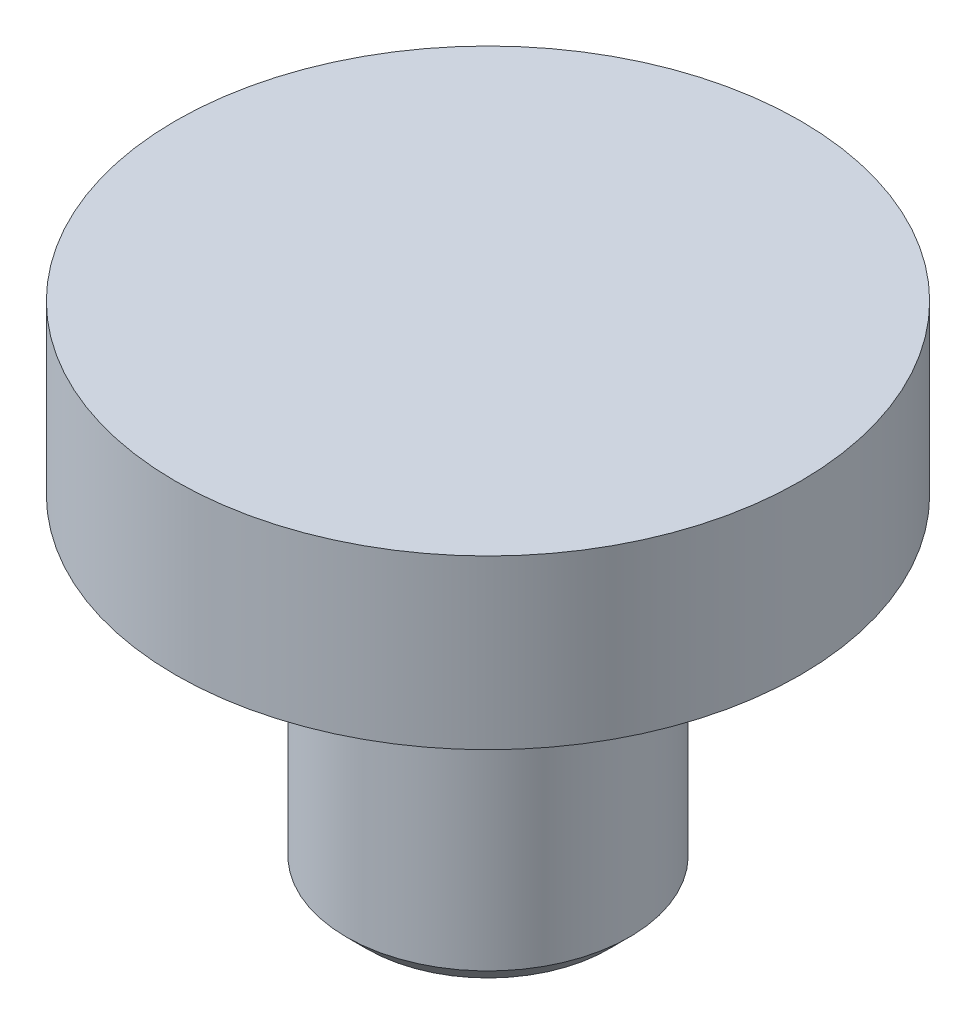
ISO-10303-21;
HEADER;
FILE_DESCRIPTION(('STEP AP214'),'2;1');
FILE_NAME('part.step','',(''),(''),'','','');
FILE_SCHEMA(('AUTOMOTIVE_DESIGN { 1 0 10303 214 1 1 1 1 }'));
ENDSEC;
DATA;
#1=APPLICATION_CONTEXT('core data for automotive mechanical design processes');
#2=APPLICATION_PROTOCOL_DEFINITION('international standard','automotive_design',2000,#1);
#3=PRODUCT_CONTEXT('',#1,'mechanical');
#4=PRODUCT('Part','Part','',(#3));
#5=PRODUCT_RELATED_PRODUCT_CATEGORY('part','',(#4));
#6=PRODUCT_DEFINITION_FORMATION('','',#4);
#7=PRODUCT_DEFINITION_CONTEXT('part definition',#1,'design');
#8=PRODUCT_DEFINITION('design','',#6,#7);
#9=PRODUCT_DEFINITION_SHAPE('','',#8);
#10=(LENGTH_UNIT() NAMED_UNIT(*) SI_UNIT(.MILLI.,.METRE.));
#11=(NAMED_UNIT(*) PLANE_ANGLE_UNIT() SI_UNIT($,.RADIAN.));
#12=(NAMED_UNIT(*) SI_UNIT($,.STERADIAN.) SOLID_ANGLE_UNIT());
#13=UNCERTAINTY_MEASURE_WITH_UNIT(LENGTH_MEASURE(1.E-05),#10,'distance_accuracy_value','');
#14=(GEOMETRIC_REPRESENTATION_CONTEXT(3) GLOBAL_UNCERTAINTY_ASSIGNED_CONTEXT((#13)) GLOBAL_UNIT_ASSIGNED_CONTEXT((#10,
#11,#12)) REPRESENTATION_CONTEXT('',''));
#15=CARTESIAN_POINT('',(0.,0.,0.));
#16=DIRECTION('',(0.,0.,1.));
#17=DIRECTION('',(1.,0.,0.));
#18=AXIS2_PLACEMENT_3D('',#15,#16,#17);
#19=CARTESIAN_POINT('',(0.,8.,0.));
#20=DIRECTION('',(0.,-1.,0.));
#21=DIRECTION('',(0.,0.,-1.));
#22=AXIS2_PLACEMENT_3D('',#19,#20,#21);
#23=CYLINDRICAL_SURFACE('',#22,3.4);
#24=CARTESIAN_POINT('',(0.,0.500000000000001,0.));
#25=DIRECTION('',(0.,1.,0.));
#26=DIRECTION('',(0.,0.,1.));
#27=AXIS2_PLACEMENT_3D('',#24,#25,#26);
#28=CIRCLE('',#27,3.4);
#29=CARTESIAN_POINT('',(0.,0.500000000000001,3.4));
#30=VERTEX_POINT('',#29);
#31=EDGE_CURVE('E38',#30,#30,#28,.T.);
#32=ORIENTED_EDGE('',*,*,#31,.T.);
#33=EDGE_LOOP('',(#32));
#34=FACE_BOUND('',#33,.T.);
#35=CARTESIAN_POINT('',(0.,8.,0.));
#36=DIRECTION('',(0.,1.,0.));
#37=DIRECTION('',(0.,0.,1.));
#38=AXIS2_PLACEMENT_3D('',#35,#36,#37);
#39=CIRCLE('',#38,3.4);
#40=CARTESIAN_POINT('',(0.,8.,3.4));
#41=VERTEX_POINT('',#40);
#42=EDGE_CURVE('E42',#41,#41,#39,.T.);
#43=ORIENTED_EDGE('',*,*,#42,.F.);
#44=EDGE_LOOP('',(#43));
#45=FACE_BOUND('',#44,.T.);
#46=ADVANCED_FACE('F31',(#34,#45),#23,.T.);
#47=CARTESIAN_POINT('',(0.,0.,0.));
#48=DIRECTION('',(0.,1.,0.));
#49=DIRECTION('',(0.,0.,1.));
#50=AXIS2_PLACEMENT_3D('',#47,#48,#49);
#51=PLANE('',#50);
#52=CARTESIAN_POINT('',(0.,0.,0.));
#53=DIRECTION('',(0.,1.,0.));
#54=DIRECTION('',(0.,0.,1.));
#55=AXIS2_PLACEMENT_3D('',#52,#53,#54);
#56=CIRCLE('',#55,2.9);
#57=CARTESIAN_POINT('',(0.,0.,2.9));
#58=VERTEX_POINT('',#57);
#59=EDGE_CURVE('E10',#58,#58,#56,.F.);
#60=ORIENTED_EDGE('',*,*,#59,.T.);
#61=EDGE_LOOP('',(#60));
#62=FACE_BOUND('',#61,.T.);
#63=ADVANCED_FACE('F66',(#62),#51,.F.);
#64=CARTESIAN_POINT('',(0.,8.,0.));
#65=DIRECTION('',(0.,1.,0.));
#66=DIRECTION('',(0.,0.,1.));
#67=AXIS2_PLACEMENT_3D('',#64,#65,#66);
#68=PLANE('',#67);
#69=CARTESIAN_POINT('',(0.,8.,0.));
#70=DIRECTION('',(0.,1.,0.));
#71=DIRECTION('',(0.,0.,1.));
#72=AXIS2_PLACEMENT_3D('',#69,#70,#71);
#73=CIRCLE('',#72,7.5);
#74=CARTESIAN_POINT('',(0.,8.,7.5));
#75=VERTEX_POINT('',#74);
#76=EDGE_CURVE('E49',#75,#75,#73,.T.);
#77=ORIENTED_EDGE('',*,*,#76,.F.);
#78=EDGE_LOOP('',(#77));
#79=FACE_BOUND('',#78,.T.);
#80=ORIENTED_EDGE('',*,*,#42,.T.);
#81=EDGE_LOOP('',(#80));
#82=FACE_BOUND('',#81,.T.);
#83=ADVANCED_FACE('F60',(#79,#82),#68,.F.);
#84=CARTESIAN_POINT('',(0.,12.0285868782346,0.));
#85=DIRECTION('',(0.,-1.,0.));
#86=DIRECTION('',(0.,0.,-1.));
#87=AXIS2_PLACEMENT_3D('',#84,#85,#86);
#88=CYLINDRICAL_SURFACE('',#87,7.5);
#89=CARTESIAN_POINT('',(0.,12.0285868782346,0.));
#90=DIRECTION('',(0.,1.,0.));
#91=DIRECTION('',(0.,0.,1.));
#92=AXIS2_PLACEMENT_3D('',#89,#90,#91);
#93=CIRCLE('',#92,7.5);
#94=CARTESIAN_POINT('',(0.,12.0285868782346,7.5));
#95=VERTEX_POINT('',#94);
#96=EDGE_CURVE('E46',#95,#95,#93,.T.);
#97=ORIENTED_EDGE('',*,*,#96,.F.);
#98=EDGE_LOOP('',(#97));
#99=FACE_BOUND('',#98,.T.);
#100=ORIENTED_EDGE('',*,*,#76,.T.);
#101=EDGE_LOOP('',(#100));
#102=FACE_BOUND('',#101,.T.);
#103=ADVANCED_FACE('F57',(#99,#102),#88,.T.);
#104=CARTESIAN_POINT('',(0.,12.0285868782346,0.));
#105=DIRECTION('',(0.,1.,0.));
#106=DIRECTION('',(0.,0.,1.));
#107=AXIS2_PLACEMENT_3D('',#104,#105,#106);
#108=PLANE('',#107);
#109=ORIENTED_EDGE('',*,*,#96,.T.);
#110=EDGE_LOOP('',(#109));
#111=FACE_BOUND('',#110,.T.);
#112=ADVANCED_FACE('F55',(#111),#108,.T.);
#113=CARTESIAN_POINT('',(0.,0.500000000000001,0.));
#114=DIRECTION('',(0.,1.,0.));
#115=DIRECTION('',(0.,0.,1.));
#116=AXIS2_PLACEMENT_3D('',#113,#114,#115);
#117=CONICAL_SURFACE('',#116,3.4,0.785398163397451);
#118=ORIENTED_EDGE('',*,*,#59,.F.);
#119=EDGE_LOOP('',(#118));
#120=FACE_BOUND('',#119,.T.);
#121=ORIENTED_EDGE('',*,*,#31,.F.);
#122=EDGE_LOOP('',(#121));
#123=FACE_BOUND('',#122,.T.);
#124=ADVANCED_FACE('F33',(#120,#123),#117,.T.);
#125=CLOSED_SHELL('',(#46,#63,#83,#103,#112,#124));
#126=MANIFOLD_SOLID_BREP('B2',#125);
#127=ADVANCED_BREP_SHAPE_REPRESENTATION('',(#18,#126),#14);
#128=SHAPE_DEFINITION_REPRESENTATION(#9,#127);
ENDSEC;
END-ISO-10303-21;
